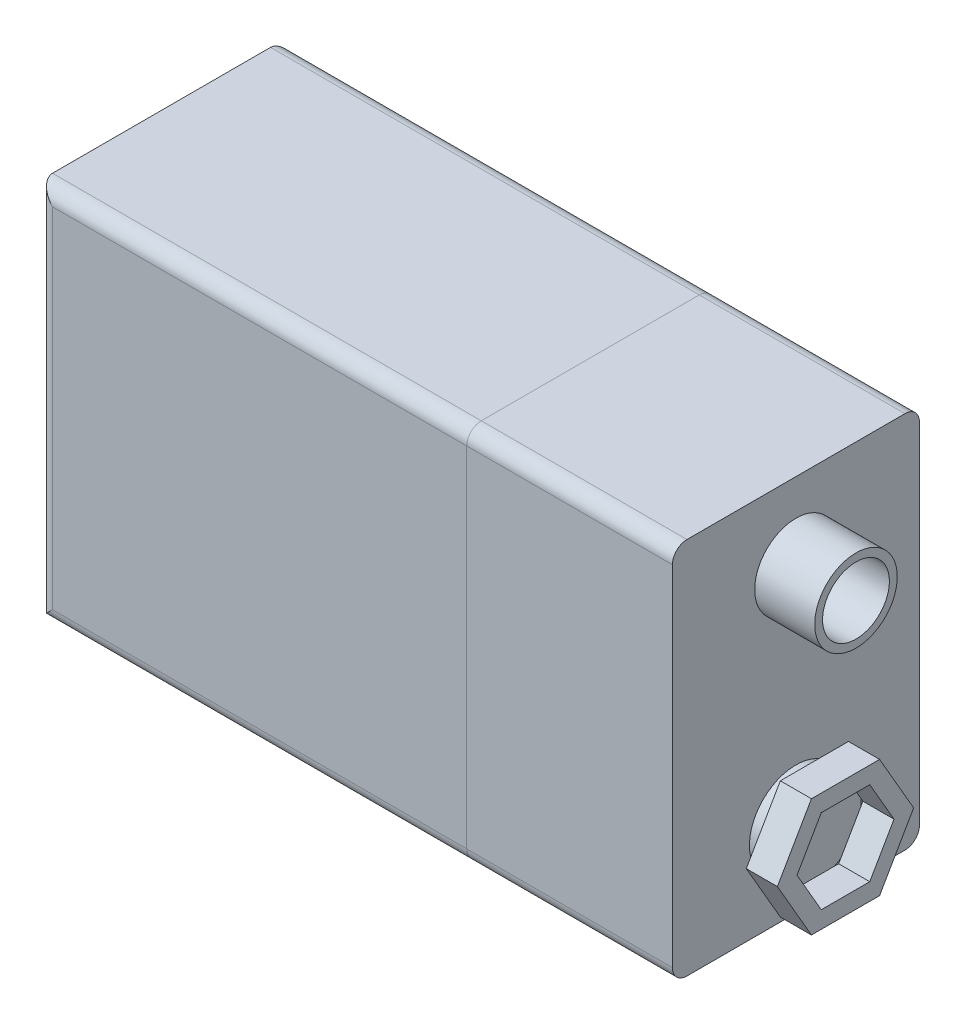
from build123d import *

# Parameters (mm, degrees)
SKETCH2_W           = 29.5
SKETCH2_H           = 17
BOSS_EXTRUDE1_DEPTH = 26.008
SKETCH7_W           = 17
SKETCH7_H           = 26.008
BOSS_EXTRUDE3_DEPTH = 14.15
SKETCH8_R           = 2.84
SKETCH8_R_2         = 2.3
BOSS_EXTRUDE4_DEPTH = 4.13
SKETCH9_R           = 3.2
BOSS_EXTRUDE5_DEPTH = 1.27
BOSS_EXTRUDE6_DEPTH = 2.14
FILLET1_R           = 1
FILLET2_R           = 1


with BuildPart() as part:
    # Sketch2 → Boss-Extrude1 (new body)
    with BuildSketch(Plane(origin=(0, 0, 0), x_dir=(1, 0, 0), z_dir=(0, 1, 0))):
        with Locations((14.75, 8.5)):
            Rectangle(SKETCH2_W, SKETCH2_H)
    extrude(amount=BOSS_EXTRUDE1_DEPTH)

    # Fillet2
    fillet2_edges = [part.edges().sort_by_distance(p)[0] for p in [
        (14.75, 26.008, -17),
        (14.75, 0, -17),
        (14.75, 0, 0),
        (0, 13.004, -17),
        (0, 13.004, 0),
        (14.75, 26.008, 0),
    ]]
    fillet(fillet2_edges, radius=FILLET2_R)


with BuildPart() as body_2:
    # Sketch7 → Boss-Extrude3 (new body)
    with BuildSketch(Plane(origin=(29.5, 0, 0), x_dir=(0, 0, -1), z_dir=(1, 0, 0))):
        with Locations((8.5, 13.004)):
            Rectangle(SKETCH7_W, SKETCH7_H)
    extrude(amount=BOSS_EXTRUDE3_DEPTH)

    # Sketch8 → Boss-Extrude4 (add)
    with BuildSketch(Plane(origin=(43.65, 0, 0), x_dir=(0, 0, -1), z_dir=(1, 0, 0))):
        with Locations((8.5, 20.688)):
            Circle(SKETCH8_R)
        with Locations((8.5, 20.688)):
            Circle(SKETCH8_R_2, mode=Mode.SUBTRACT)
    extrude(amount=BOSS_EXTRUDE4_DEPTH)

    # Sketch9 → Boss-Extrude5 (add)
    with BuildSketch(Plane(origin=(43.65, 0, 0), x_dir=(0, 0, -1), z_dir=(1, 0, 0))):
        with Locations((8.5, 5.63)):
            Circle(SKETCH9_R)
    extrude(amount=BOSS_EXTRUDE5_DEPTH)

    # Sketch10 → Boss-Extrude6 (add)
    with BuildSketch(Plane(origin=(44.92, 0, 0), x_dir=(0, 0, -1), z_dir=(1, 0, 0))):
        Polygon((13.188084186, 5.63), (10.844042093, 9.69), (6.155957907, 9.69), (3.811915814, 5.63), (6.155957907, 1.57), (10.844042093, 1.57), align=None)
        Polygon((11.837084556, 5.63), (10.168542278, 8.52), (6.831457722, 8.52), (5.162915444, 5.63), (6.831457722, 2.74), (10.168542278, 2.74), align=None, mode=Mode.SUBTRACT)
    extrude(amount=BOSS_EXTRUDE6_DEPTH)

    # Fillet1
    fillet1_edges = [body_2.edges().sort_by_distance(p)[0] for p in [
        (36.575, 26.008, 0),
        (36.575, 26.008, -17),
        (36.575, 0, -17),
        (36.575, 0, 0),
    ]]
    fillet(fillet1_edges, radius=FILLET1_R)


solid = Compound([part.part, body_2.part])
